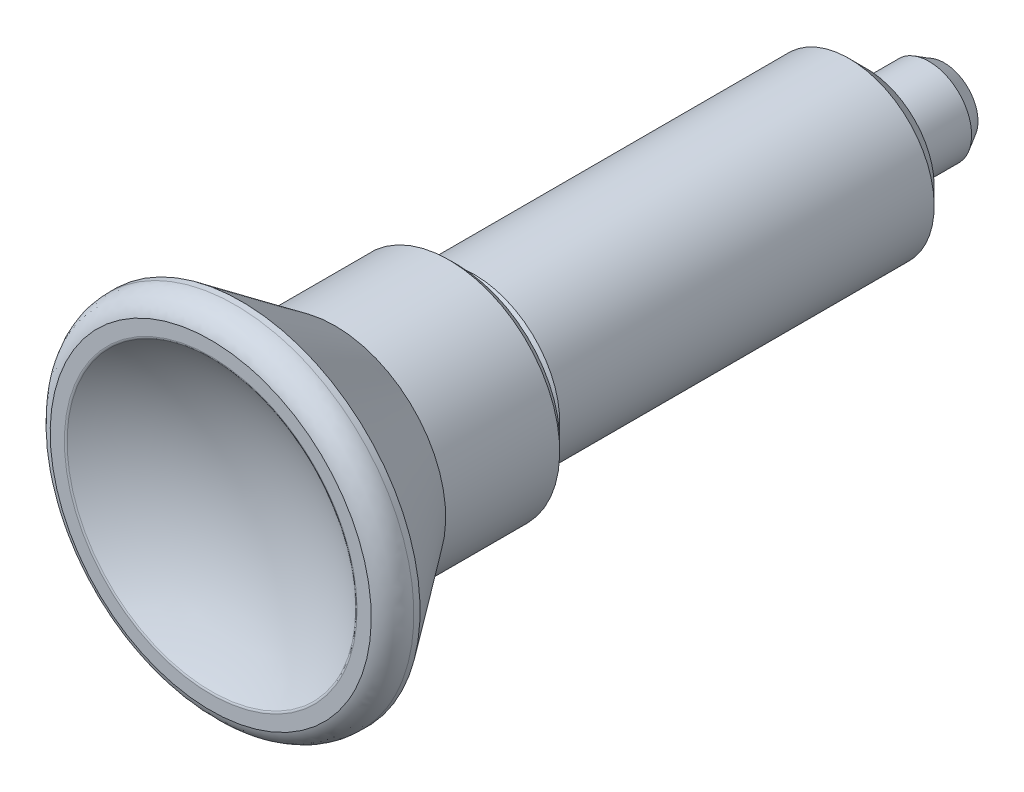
ISO-10303-21;
HEADER;
FILE_DESCRIPTION(('STEP AP214'),'2;1');
FILE_NAME('part.step','',(''),(''),'','','');
FILE_SCHEMA(('AUTOMOTIVE_DESIGN { 1 0 10303 214 1 1 1 1 }'));
ENDSEC;
DATA;
#1=APPLICATION_CONTEXT('core data for automotive mechanical design processes');
#2=APPLICATION_PROTOCOL_DEFINITION('international standard','automotive_design',2000,#1);
#3=PRODUCT_CONTEXT('',#1,'mechanical');
#4=PRODUCT('Part','Part','',(#3));
#5=PRODUCT_RELATED_PRODUCT_CATEGORY('part','',(#4));
#6=PRODUCT_DEFINITION_FORMATION('','',#4);
#7=PRODUCT_DEFINITION_CONTEXT('part definition',#1,'design');
#8=PRODUCT_DEFINITION('design','',#6,#7);
#9=PRODUCT_DEFINITION_SHAPE('','',#8);
#10=(LENGTH_UNIT() NAMED_UNIT(*) SI_UNIT(.MILLI.,.METRE.));
#11=(NAMED_UNIT(*) PLANE_ANGLE_UNIT() SI_UNIT($,.RADIAN.));
#12=(NAMED_UNIT(*) SI_UNIT($,.STERADIAN.) SOLID_ANGLE_UNIT());
#13=UNCERTAINTY_MEASURE_WITH_UNIT(LENGTH_MEASURE(1.E-05),#10,'distance_accuracy_value','');
#14=(GEOMETRIC_REPRESENTATION_CONTEXT(3) GLOBAL_UNCERTAINTY_ASSIGNED_CONTEXT((#13)) GLOBAL_UNIT_ASSIGNED_CONTEXT((#10,
#11,#12)) REPRESENTATION_CONTEXT('',''));
#15=CARTESIAN_POINT('',(0.,0.,0.));
#16=DIRECTION('',(0.,0.,1.));
#17=DIRECTION('',(1.,0.,0.));
#18=AXIS2_PLACEMENT_3D('',#15,#16,#17);
#19=CARTESIAN_POINT('',(-4.42791074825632E-10,6.64607258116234E-11,1.52503010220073E-10));
#20=DIRECTION('',(-0.923728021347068,-0.383049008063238,0.));
#21=DIRECTION('',(0.,0.,-1.));
#22=AXIS2_PLACEMENT_3D('',#19,#20,#21);
#23=SPHERICAL_SURFACE('',#22,5.);
#24=CARTESIAN_POINT('',(0.,0.,-4.58812253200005));
#25=DIRECTION('',(0.,0.,1.));
#26=DIRECTION('',(0.923728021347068,0.383049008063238,0.));
#27=AXIS2_PLACEMENT_3D('',#24,#25,#26);
#28=CIRCLE('',#27,1.987242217);
#29=CARTESIAN_POINT('',(-1.83428256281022,-0.764551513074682,-4.5881225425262));
#30=VERTEX_POINT('',#29);
#31=CARTESIAN_POINT('',(1.8370555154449,0.757868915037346,-4.5881218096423));
#32=VERTEX_POINT('',#31);
#33=EDGE_CURVE('E42',#30,#32,#28,.T.);
#34=ORIENTED_EDGE('',*,*,#33,.F.);
#35=CARTESIAN_POINT('',(-1.83566823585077,-0.761209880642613,0.));
#36=DIRECTION('',(-0.923728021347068,-0.383049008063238,0.));
#37=DIRECTION('',(-1.92852821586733E-11,4.65064313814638E-11,1.));
#38=AXIS2_PLACEMENT_3D('',#35,#36,#37);
#39=CIRCLE('',#38,4.58812397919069);
#40=CARTESIAN_POINT('',(-1.83567054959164,-0.761210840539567,-4.58812289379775));
#41=VERTEX_POINT('',#40);
#42=EDGE_CURVE('E39',#30,#41,#39,.F.);
#43=ORIENTED_EDGE('',*,*,#42,.T.);
#44=CARTESIAN_POINT('',(0.,0.,-4.58812253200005));
#45=DIRECTION('',(0.,0.,1.));
#46=DIRECTION('',(0.923728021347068,0.383049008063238,0.));
#47=AXIS2_PLACEMENT_3D('',#44,#45,#46);
#48=CIRCLE('',#47,1.987242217);
#49=CARTESIAN_POINT('',(1.83567134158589,0.76121116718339,-4.58812252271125));
#50=VERTEX_POINT('',#49);
#51=EDGE_CURVE('E18',#50,#41,#48,.T.);
#52=ORIENTED_EDGE('',*,*,#51,.F.);
#53=CARTESIAN_POINT('',(1.83567136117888,0.761211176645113,0.));
#54=DIRECTION('',(-0.923728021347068,-0.383049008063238,0.));
#55=DIRECTION('',(-1.92852883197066E-11,4.65064462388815E-11,1.));
#56=AXIS2_PLACEMENT_3D('',#53,#54,#55);
#57=CIRCLE('',#56,4.58812251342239);
#58=EDGE_CURVE('E32',#50,#32,#57,.T.);
#59=ORIENTED_EDGE('',*,*,#58,.T.);
#60=EDGE_LOOP('',(#34,#43,#52,#59));
#61=FACE_BOUND('',#60,.T.);
#62=ADVANCED_FACE('F14',(#61),#23,.T.);
#63=CARTESIAN_POINT('',(0.,0.,-4.58812253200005));
#64=DIRECTION('',(0.,0.,1.));
#65=DIRECTION('',(0.923728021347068,0.383049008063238,0.));
#66=AXIS2_PLACEMENT_3D('',#63,#64,#65);
#67=CONICAL_SURFACE('',#66,1.987242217,0.523598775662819);
#68=ORIENTED_EDGE('',*,*,#51,.T.);
#69=ORIENTED_EDGE('',*,*,#42,.F.);
#70=ORIENTED_EDGE('',*,*,#33,.T.);
#71=ORIENTED_EDGE('',*,*,#58,.F.);
#72=EDGE_LOOP('',(#68,#69,#70,#71));
#73=FACE_BOUND('',#72,.T.);
#74=CARTESIAN_POINT('',(0.,0.,-3.7));
#75=DIRECTION('',(0.,0.,-1.));
#76=DIRECTION('',(-0.923728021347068,-0.383049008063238,0.));
#77=AXIS2_PLACEMENT_3D('',#74,#75,#76);
#78=CIRCLE('',#77,2.5);
#79=CARTESIAN_POINT('',(-2.30932005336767,-0.957622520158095,-3.7));
#80=VERTEX_POINT('',#79);
#81=EDGE_CURVE('E47',#80,#80,#78,.F.);
#82=ORIENTED_EDGE('',*,*,#81,.F.);
#83=EDGE_LOOP('',(#82));
#84=FACE_BOUND('',#83,.T.);
#85=ADVANCED_FACE('F45',(#73,#84),#67,.T.);
#86=CARTESIAN_POINT('',(0.,0.,0.));
#87=DIRECTION('',(0.,0.,-1.));
#88=DIRECTION('',(-0.923728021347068,-0.383049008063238,0.));
#89=AXIS2_PLACEMENT_3D('',#86,#87,#88);
#90=CYLINDRICAL_SURFACE('',#89,2.5);
#91=CARTESIAN_POINT('',(0.,0.,0.));
#92=DIRECTION('',(0.,0.,-1.));
#93=DIRECTION('',(-0.923728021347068,-0.383049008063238,0.));
#94=AXIS2_PLACEMENT_3D('',#91,#92,#93);
#95=CIRCLE('',#94,2.5);
#96=CARTESIAN_POINT('',(-2.30932005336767,-0.957622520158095,0.));
#97=VERTEX_POINT('',#96);
#98=EDGE_CURVE('E346',#97,#97,#95,.F.);
#99=ORIENTED_EDGE('',*,*,#98,.F.);
#100=EDGE_LOOP('',(#99));
#101=FACE_BOUND('',#100,.T.);
#102=ORIENTED_EDGE('',*,*,#81,.T.);
#103=EDGE_LOOP('',(#102));
#104=FACE_BOUND('',#103,.T.);
#105=ADVANCED_FACE('F64',(#101,#104),#90,.T.);
#106=CARTESIAN_POINT('',(5.29516892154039,-2.20153529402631,0.));
#107=DIRECTION('',(0.,0.,-1.));
#108=DIRECTION('',(-0.923728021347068,-0.383049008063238,0.));
#109=AXIS2_PLACEMENT_3D('',#106,#107,#108);
#110=PLANE('',#109);
#111=ORIENTED_EDGE('',*,*,#98,.T.);
#112=EDGE_LOOP('',(#111));
#113=FACE_BOUND('',#112,.T.);
#114=CARTESIAN_POINT('',(0.,0.,0.));
#115=DIRECTION('',(0.,0.,1.));
#116=DIRECTION('',(0.923728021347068,0.383049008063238,0.));
#117=AXIS2_PLACEMENT_3D('',#114,#115,#116);
#118=CIRCLE('',#117,4.0000000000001);
#119=CARTESIAN_POINT('',(3.69491208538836,1.53219603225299,0.));
#120=VERTEX_POINT('',#119);
#121=EDGE_CURVE('E349',#120,#120,#118,.T.);
#122=ORIENTED_EDGE('',*,*,#121,.F.);
#123=EDGE_LOOP('',(#122));
#124=FACE_BOUND('',#123,.T.);
#125=ADVANCED_FACE('F16',(#113,#124),#110,.T.);
#126=CARTESIAN_POINT('',(0.,0.,0.));
#127=DIRECTION('',(0.,0.,1.));
#128=DIRECTION('',(0.923728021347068,0.383049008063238,0.));
#129=AXIS2_PLACEMENT_3D('',#126,#127,#128);
#130=CONICAL_SURFACE('',#129,4.,0.785398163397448);
#131=CARTESIAN_POINT('',(0.,0.,1.));
#132=DIRECTION('',(0.,0.,-1.));
#133=DIRECTION('',(-0.923728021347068,-0.383049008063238,0.));
#134=AXIS2_PLACEMENT_3D('',#131,#132,#133);
#135=CIRCLE('',#134,5.);
#136=CARTESIAN_POINT('',(-4.61864010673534,-1.91524504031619,0.999999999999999));
#137=VERTEX_POINT('',#136);
#138=EDGE_CURVE('E351',#137,#137,#135,.F.);
#139=ORIENTED_EDGE('',*,*,#138,.F.);
#140=EDGE_LOOP('',(#139));
#141=FACE_BOUND('',#140,.T.);
#142=ORIENTED_EDGE('',*,*,#121,.T.);
#143=EDGE_LOOP('',(#142));
#144=FACE_BOUND('',#143,.T.);
#145=ADVANCED_FACE('F68',(#141,#144),#130,.T.);
#146=CARTESIAN_POINT('',(0.,0.,23.));
#147=DIRECTION('',(0.,0.,-1.));
#148=DIRECTION('',(-0.923728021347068,-0.383049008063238,0.));
#149=AXIS2_PLACEMENT_3D('',#146,#147,#148);
#150=CYLINDRICAL_SURFACE('',#149,5.);
#151=ORIENTED_EDGE('',*,*,#138,.T.);
#152=EDGE_LOOP('',(#151));
#153=FACE_BOUND('',#152,.T.);
#154=CARTESIAN_POINT('',(0.,0.,23.));
#155=DIRECTION('',(0.,0.,-1.));
#156=DIRECTION('',(-0.923728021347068,-0.383049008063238,0.));
#157=AXIS2_PLACEMENT_3D('',#154,#155,#156);
#158=CIRCLE('',#157,5.);
#159=CARTESIAN_POINT('',(-4.61864010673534,-1.91524504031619,22.9999999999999));
#160=VERTEX_POINT('',#159);
#161=EDGE_CURVE('E24',#160,#160,#158,.F.);
#162=ORIENTED_EDGE('',*,*,#161,.F.);
#163=EDGE_LOOP('',(#162));
#164=FACE_BOUND('',#163,.T.);
#165=ADVANCED_FACE('F71',(#153,#164),#150,.T.);
#166=CARTESIAN_POINT('',(0.,0.,24.));
#167=DIRECTION('',(0.,0.,-1.));
#168=DIRECTION('',(-0.923728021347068,-0.383049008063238,0.));
#169=AXIS2_PLACEMENT_3D('',#166,#167,#168);
#170=CONICAL_SURFACE('',#169,4.,0.785398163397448);
#171=ORIENTED_EDGE('',*,*,#161,.T.);
#172=EDGE_LOOP('',(#171));
#173=FACE_BOUND('',#172,.T.);
#174=CARTESIAN_POINT('',(0.,0.,24.));
#175=DIRECTION('',(0.,0.,-1.));
#176=DIRECTION('',(-0.923728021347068,-0.383049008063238,0.));
#177=AXIS2_PLACEMENT_3D('',#174,#175,#176);
#178=CIRCLE('',#177,4.);
#179=CARTESIAN_POINT('',(-3.69491208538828,-1.53219603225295,24.));
#180=VERTEX_POINT('',#179);
#181=EDGE_CURVE('E9',#180,#180,#178,.T.);
#182=ORIENTED_EDGE('',*,*,#181,.T.);
#183=EDGE_LOOP('',(#182));
#184=FACE_BOUND('',#183,.T.);
#185=ADVANCED_FACE('F74',(#173,#184),#170,.T.);
#186=CARTESIAN_POINT('',(0.,0.,49.6055276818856));
#187=DIRECTION('',(0.,0.,-1.));
#188=DIRECTION('',(-0.923728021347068,-0.383049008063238,0.));
#189=AXIS2_PLACEMENT_3D('',#186,#187,#188);
#190=SPHERICAL_SURFACE('',#189,14.0000000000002);
#191=CARTESIAN_POINT('',(0.,0.,38.4646826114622));
#192=DIRECTION('',(0.,0.,-1.));
#193=DIRECTION('',(-0.923728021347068,-0.383049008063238,0.));
#194=AXIS2_PLACEMENT_3D('',#191,#192,#193);
#195=CIRCLE('',#194,8.47830001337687);
#196=CARTESIAN_POINT('',(-7.83164329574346,-3.24760441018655,38.4646826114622));
#197=VERTEX_POINT('',#196);
#198=EDGE_CURVE('E50',#197,#197,#195,.T.);
#199=ORIENTED_EDGE('',*,*,#198,.F.);
#200=EDGE_LOOP('',(#199));
#201=FACE_BOUND('',#200,.T.);
#202=ADVANCED_FACE('F60',(#201),#190,.F.);
#203=CARTESIAN_POINT('',(-7.83164329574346,-3.24760441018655,38.4646826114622));
#204=CARTESIAN_POINT('',(-7.88122176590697,-3.26816347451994,38.5055276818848));
#205=CARTESIAN_POINT('',(-7.94352391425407,-3.2939987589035,38.5055276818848));
#206=CARTESIAN_POINT('',(-13.4566591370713,10.3171996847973,38.4646826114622));
#207=CARTESIAN_POINT('',(-13.5418469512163,10.3825130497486,38.5055276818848));
#208=CARTESIAN_POINT('',(-13.6488971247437,10.4645882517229,38.5055276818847));
#209=CARTESIAN_POINT('',(1.10331372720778,8.40620425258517,38.4646826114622));
#210=CARTESIAN_POINT('',(1.11029829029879,8.45941999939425,38.5055276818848));
#211=CARTESIAN_POINT('',(1.11907535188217,8.52629288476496,38.5055276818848));
#212=CARTESIAN_POINT('',(15.6632865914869,6.49520882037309,38.4646826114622));
#213=CARTESIAN_POINT('',(15.7624435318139,6.53632694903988,38.5055276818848));
#214=CARTESIAN_POINT('',(15.8870478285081,6.58799751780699,38.5055276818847));
#215=CARTESIAN_POINT('',(6.72832956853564,-5.15859984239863,38.4646826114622));
#216=CARTESIAN_POINT('',(6.77092347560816,-5.19125652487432,38.5055276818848));
#217=CARTESIAN_POINT('',(6.82444856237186,-5.23229412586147,38.5055276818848));
#218=CARTESIAN_POINT('',(-2.20662745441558,-16.8124085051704,38.4646826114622));
#219=CARTESIAN_POINT('',(-2.2205965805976,-16.9188399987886,38.5055276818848));
#220=CARTESIAN_POINT('',(-2.23815070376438,-17.0525857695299,38.5055276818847));
#221=CARTESIAN_POINT('',(-7.83164329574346,-3.24760441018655,38.4646826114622));
#222=CARTESIAN_POINT('',(-7.88122176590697,-3.26816347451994,38.5055276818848));
#223=CARTESIAN_POINT('',(-7.94352391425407,-3.2939987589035,38.5055276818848));
#224=(BOUNDED_SURFACE() B_SPLINE_SURFACE(2,2,((#203,#204,#205),(#206,#207,#208),(#209,#210,
#211),(#212,#213,#214),(#215,#216,#217),(#218,#219,#220),(#221,#222,#223)),.UNSPECIFIED.,.T.,
.F.,.F.) B_SPLINE_SURFACE_WITH_KNOTS((3,2,2,3),(3,3),(0.,219.195240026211,438.390480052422,
657.585720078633),(0.,1.),
.UNSPECIFIED.) GEOMETRIC_REPRESENTATION_ITEM() RATIONAL_B_SPLINE_SURFACE(((1.,0.947569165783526,
1.),(0.5,0.473784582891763,0.5),(1.,0.947569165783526,1.),(0.5,0.473784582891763,0.5),(1.,
0.947569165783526,1.),(0.5,0.473784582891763,0.5),(1.,0.947569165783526,1.))) REPRESENTATION_ITEM('') SURFACE());
#225=CARTESIAN_POINT('',(0.,0.,38.5055276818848));
#226=DIRECTION('',(0.,0.,1.));
#227=DIRECTION('',(-0.923728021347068,-0.383049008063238,0.));
#228=AXIS2_PLACEMENT_3D('',#225,#226,#227);
#229=CIRCLE('',#228,8.59941858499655);
#230=CARTESIAN_POINT('',(-7.94352391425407,-3.2939987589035,38.5055276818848));
#231=VERTEX_POINT('',#230);
#232=EDGE_CURVE('E146',#231,#231,#229,.T.);
#233=CARTESIAN_POINT('',(-7.83164329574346,-3.24760441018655,38.4646826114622));
#234=CARTESIAN_POINT('',(-7.83262359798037,-3.2480109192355,38.4654902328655));
#235=CARTESIAN_POINT('',(-7.83361136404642,-3.2484205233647,38.4662872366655));
#236=CARTESIAN_POINT('',(-7.83560449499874,-3.24924702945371,38.467862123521));
#237=CARTESIAN_POINT('',(-7.8366099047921,-3.24966395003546,38.4686399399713));
#238=CARTESIAN_POINT('',(-7.83863786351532,-3.25050489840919,38.4701757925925));
#239=CARTESIAN_POINT('',(-7.83966045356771,-3.25092894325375,38.4709337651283));
#240=CARTESIAN_POINT('',(-7.84172228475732,-3.25178393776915,38.4724292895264));
#241=CARTESIAN_POINT('',(-7.84276156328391,-3.25221490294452,38.4731667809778));
#242=CARTESIAN_POINT('',(-7.84485625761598,-3.2530835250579,38.4746207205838));
#243=CARTESIAN_POINT('',(-7.84591170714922,-3.25352119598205,38.4753371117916));
#244=CARTESIAN_POINT('',(-7.84803820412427,-3.2544030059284,38.4767482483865));
#245=CARTESIAN_POINT('',(-7.84910928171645,-3.25484715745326,38.4774429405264));
#246=CARTESIAN_POINT('',(-7.85126647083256,-3.25574169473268,38.4788100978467));
#247=CARTESIAN_POINT('',(-7.85235260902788,-3.25619209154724,38.479482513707));
#248=CARTESIAN_POINT('',(-7.85453933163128,-3.25709887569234,38.4808045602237));
#249=CARTESIAN_POINT('',(-7.85563993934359,-3.25755527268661,38.4814541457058));
#250=CARTESIAN_POINT('',(-7.85785499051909,-3.25847380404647,38.4827299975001));
#251=CARTESIAN_POINT('',(-7.8589694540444,-3.25893594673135,38.4833562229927));
#252=CARTESIAN_POINT('',(-7.86121158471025,-3.25986570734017,38.4845848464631));
#253=CARTESIAN_POINT('',(-7.86233926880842,-3.26033333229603,38.4851872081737));
#254=CARTESIAN_POINT('',(-7.86460718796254,-3.26127378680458,38.4863676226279));
#255=CARTESIAN_POINT('',(-7.8657474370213,-3.26174662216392,38.486945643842));
#256=CARTESIAN_POINT('',(-7.86803981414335,-3.26269721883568,38.4880769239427));
#257=CARTESIAN_POINT('',(-7.86919195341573,-3.26317498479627,38.48863015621));
#258=CARTESIAN_POINT('',(-7.87150742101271,-3.26413515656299,38.4897114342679));
#259=CARTESIAN_POINT('',(-7.87267075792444,-3.26461756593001,38.4902394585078));
#260=CARTESIAN_POINT('',(-7.87500791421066,-3.26558673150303,38.4912699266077));
#261=CARTESIAN_POINT('',(-7.8761817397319,-3.26607349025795,38.4917723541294));
#262=CARTESIAN_POINT('',(-7.87853915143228,-3.26705105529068,38.492751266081));
#263=CARTESIAN_POINT('',(-7.87972274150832,-3.26754186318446,38.4932277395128));
#264=CARTESIAN_POINT('',(-7.88209894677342,-3.26852722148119,38.4941544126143));
#265=CARTESIAN_POINT('',(-7.88329156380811,-3.26902177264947,38.4946046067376));
#266=CARTESIAN_POINT('',(-7.88568507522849,-3.27001430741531,38.4954784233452));
#267=CARTESIAN_POINT('',(-7.88688596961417,-3.27051229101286,38.4959020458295));
#268=CARTESIAN_POINT('',(-7.8892952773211,-3.27151137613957,38.4967224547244));
#269=CARTESIAN_POINT('',(-7.89050368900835,-3.27201247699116,38.4971192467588));
#270=CARTESIAN_POINT('',(-7.89292726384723,-3.27301747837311,38.4978857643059));
#271=CARTESIAN_POINT('',(-7.89414242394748,-3.27352137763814,38.4982555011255));
#272=CARTESIAN_POINT('',(-7.8965787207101,-3.27453165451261,38.4989677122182));
#273=CARTESIAN_POINT('',(-7.89779985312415,-3.27503803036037,38.4993102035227));
#274=CARTESIAN_POINT('',(-7.90024731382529,-3.27605293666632,38.4999677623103));
#275=CARTESIAN_POINT('',(-7.90147363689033,-3.27656146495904,38.5002828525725));
#276=CARTESIAN_POINT('',(-7.90393069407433,-3.27758035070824,38.5008854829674));
#277=CARTESIAN_POINT('',(-7.90516142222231,-3.27809070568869,38.5011730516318));
#278=CARTESIAN_POINT('',(-7.90762650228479,-3.27911291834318,38.5017205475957));
#279=CARTESIAN_POINT('',(-7.90886084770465,-3.27962477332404,38.5019805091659));
#280=CARTESIAN_POINT('',(-7.91133237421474,-3.28064965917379,38.5024727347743));
#281=CARTESIAN_POINT('',(-7.91256954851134,-3.28116268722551,38.5027050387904));
#282=CARTESIAN_POINT('',(-7.91504594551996,-3.28218959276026,38.5031419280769));
#283=CARTESIAN_POINT('',(-7.91628516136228,-3.28270346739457,38.503346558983));
#284=CARTESIAN_POINT('',(-7.91876485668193,-3.28373174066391,38.5037281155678));
#285=CARTESIAN_POINT('',(-7.9200053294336,-3.28424613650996,38.5039050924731));
#286=CARTESIAN_POINT('',(-7.92248675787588,-3.28527512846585,38.5042313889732));
#287=CARTESIAN_POINT('',(-7.92372770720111,-3.28578972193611,38.5043807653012));
#288=CARTESIAN_POINT('',(-7.92620931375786,-3.28681878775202,38.5046519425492));
#289=CARTESIAN_POINT('',(-7.92744996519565,-3.28733325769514,38.5047738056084));
#290=CARTESIAN_POINT('',(-7.92993020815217,-3.28836175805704,38.5049900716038));
#291=CARTESIAN_POINT('',(-7.93116979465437,-3.28887578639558,38.5050845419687));
#292=CARTESIAN_POINT('',(-7.93364714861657,-3.28990308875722,38.5052461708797));
#293=CARTESIAN_POINT('',(-7.93488491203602,-3.29041636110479,38.5053134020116));
#294=CARTESIAN_POINT('',(-7.93735787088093,-3.29144184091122,38.5054207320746));
#295=CARTESIAN_POINT('',(-7.938593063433,-3.29195404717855,38.5054609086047));
#296=CARTESIAN_POINT('',(-7.94106014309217,-3.29297708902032,38.5055143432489));
#297=CARTESIAN_POINT('',(-7.94229202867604,-3.29348792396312,38.5055276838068));
#298=CARTESIAN_POINT('',(-7.94352391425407,-3.2939987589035,38.5055276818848));
#299=B_SPLINE_CURVE_WITH_KNOTS('',3,(#233,#234,#235,#236,#237,#238,#239,#240,#241,#242,#243,
#244,#245,#246,#247,#248,#249,#250,#251,#252,#253,#254,#255,#256,#257,#258,#259,#260,#261,#262,
#263,#264,#265,#266,#267,#268,#269,#270,#271,#272,#273,#274,#275,#276,#277,#278,#279,#280,#281,
#282,#283,#284,#285,#286,#287,#288,#289,#290,#291,#292,#293,#294,#295,#296,#297,#298),
.UNSPECIFIED.,.F.,.F.,(4,2,2,2,2,2,2,2,2,2,2,2,2,2,2,2,2,2,2,2,2,2,2,2,2,2,2,2,2,2,2,2,4),(0.,
0.0040007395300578,0.00801382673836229,0.0120385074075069,0.0160740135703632,0.0201195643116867,
0.0241743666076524,0.0282376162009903,0.032308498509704,0.0363861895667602,0.0404698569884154,
0.0445586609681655,0.0486517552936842,0.0527482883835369,0.0568474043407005,0.0609482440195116,
0.0650499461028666,0.069151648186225,0.0732524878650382,0.0773516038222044,0.0814481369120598,
0.0855412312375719,0.0896300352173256,0.0937137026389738,0.0977913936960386,0.101862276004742,
0.105925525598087,0.109980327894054,0.114025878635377,0.11806138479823,0.122086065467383,
0.126099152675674,0.13009989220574),.UNSPECIFIED.);
#300=EDGE_CURVE('BSEAM83',#197,#231,#299,.T.);
#301=ORIENTED_EDGE('',*,*,#198,.T.);
#302=ORIENTED_EDGE('',*,*,#232,.T.);
#303=ORIENTED_EDGE('',*,*,#300,.T.);
#304=ORIENTED_EDGE('',*,*,#300,.F.);
#305=EDGE_LOOP('',(#301,#303,#302,#304));
#306=FACE_BOUND('',#305,.T.);
#307=ADVANCED_FACE('F83',(#306),#224,.T.);
#308=CARTESIAN_POINT('',(5.60947778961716,13.5576498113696,38.5055276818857));
#309=DIRECTION('',(0.,0.,1.));
#310=DIRECTION('',(-0.923728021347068,-0.383049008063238,0.));
#311=AXIS2_PLACEMENT_3D('',#308,#309,#310);
#312=PLANE('',#311);
#313=CARTESIAN_POINT('',(0.,0.,38.5055276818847));
#314=DIRECTION('',(0.,0.,-1.));
#315=DIRECTION('',(-0.923728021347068,-0.383049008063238,0.));
#316=AXIS2_PLACEMENT_3D('',#313,#314,#315);
#317=CIRCLE('',#316,9.43170557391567);
#318=CARTESIAN_POINT('',(-8.71233072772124,-3.61280546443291,38.5055276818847));
#319=VERTEX_POINT('',#318);
#320=EDGE_CURVE('E153',#319,#319,#317,.T.);
#321=ORIENTED_EDGE('',*,*,#320,.F.);
#322=EDGE_LOOP('',(#321));
#323=FACE_BOUND('',#322,.T.);
#324=ORIENTED_EDGE('',*,*,#232,.F.);
#325=EDGE_LOOP('',(#324));
#326=FACE_BOUND('',#325,.T.);
#327=ADVANCED_FACE('F120',(#323,#326),#312,.T.);
#328=CARTESIAN_POINT('',(-8.71233072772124,-3.61280546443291,38.5055276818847));
#329=CARTESIAN_POINT('',(-9.69914422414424,-4.02201458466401,38.1844850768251));
#330=CARTESIAN_POINT('',(-9.69914422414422,-4.022014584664,37.0689935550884));
#331=CARTESIAN_POINT('',(-14.9698933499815,11.4773940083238,38.5055276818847));
#332=CARTESIAN_POINT('',(-16.6654778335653,12.777396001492,38.1844850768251));
#333=CARTESIAN_POINT('',(-16.6654778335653,12.777396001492,37.0689935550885));
#334=CARTESIAN_POINT('',(1.22738405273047,9.35150246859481,38.5055276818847));
#335=CARTESIAN_POINT('',(1.36640530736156,10.41071258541,38.1844850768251));
#336=CARTESIAN_POINT('',(1.36640530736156,10.41071258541,37.0689935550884));
#337=CARTESIAN_POINT('',(17.4246614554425,7.22561092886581,38.5055276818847));
#338=CARTESIAN_POINT('',(19.3982884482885,8.044029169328,38.1844850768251));
#339=CARTESIAN_POINT('',(19.3982884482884,8.04402916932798,37.0689935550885));
#340=CARTESIAN_POINT('',(7.48494667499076,-5.73869700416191,38.5055276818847));
#341=CARTESIAN_POINT('',(8.33273891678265,-6.38869800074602,38.1844850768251));
#342=CARTESIAN_POINT('',(8.33273891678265,-6.38869800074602,37.0689935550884));
#343=CARTESIAN_POINT('',(-2.45476810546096,-18.7030049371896,38.5055276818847));
#344=CARTESIAN_POINT('',(-2.73281061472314,-20.82142517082,38.1844850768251));
#345=CARTESIAN_POINT('',(-2.73281061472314,-20.82142517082,37.0689935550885));
#346=CARTESIAN_POINT('',(-8.71233072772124,-3.61280546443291,38.5055276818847));
#347=CARTESIAN_POINT('',(-9.69914422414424,-4.02201458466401,38.1844850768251));
#348=CARTESIAN_POINT('',(-9.69914422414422,-4.022014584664,37.0689935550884));
#349=(BOUNDED_SURFACE() B_SPLINE_SURFACE(2,2,((#328,#329,#330),(#331,#332,#333),(#334,#335,
#336),(#337,#338,#339),(#340,#341,#342),(#343,#344,#345),(#346,#347,#348)),.UNSPECIFIED.,.T.,
.F.,.F.) B_SPLINE_SURFACE_WITH_KNOTS((3,2,2,3),(3,3),(0.,15.8434592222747,31.6869184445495,
47.5303776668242),(0.,1.),
.UNSPECIFIED.) GEOMETRIC_REPRESENTATION_ITEM() RATIONAL_B_SPLINE_SURFACE(((1.,0.802434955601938,
1.),(0.5,0.401217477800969,0.5),(1.,0.802434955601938,1.),(0.5,0.401217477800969,0.5),(1.,
0.802434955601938,1.),(0.5,0.401217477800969,0.5),(1.,0.802434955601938,1.))) REPRESENTATION_ITEM('') SURFACE());
#350=CARTESIAN_POINT('',(0.,0.,37.0689935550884));
#351=DIRECTION('',(0.,0.,-1.));
#352=DIRECTION('',(-0.923728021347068,-0.383049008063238,0.));
#353=AXIS2_PLACEMENT_3D('',#350,#351,#352);
#354=CIRCLE('',#353,10.5);
#355=CARTESIAN_POINT('',(-9.69914422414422,-4.022014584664,37.0689935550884));
#356=VERTEX_POINT('',#355);
#357=EDGE_CURVE('E158',#356,#356,#354,.T.);
#358=CARTESIAN_POINT('',(-8.71233072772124,-3.61280546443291,38.5055276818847));
#359=CARTESIAN_POINT('',(-8.71646131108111,-3.61451832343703,38.5041838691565));
#360=CARTESIAN_POINT('',(-8.72058609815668,-3.61622877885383,38.5028191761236));
#361=CARTESIAN_POINT('',(-8.72883629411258,-3.61964994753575,38.5000439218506));
#362=CARTESIAN_POINT('',(-8.73296166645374,-3.62136064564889,38.4986332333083));
#363=CARTESIAN_POINT('',(-8.74121243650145,-3.62478205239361,38.4957657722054));
#364=CARTESIAN_POINT('',(-8.74533779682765,-3.62649274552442,38.4943088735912));
#365=CARTESIAN_POINT('',(-8.75358793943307,-3.6299138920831,38.4913487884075));
#366=CARTESIAN_POINT('',(-8.75771268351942,-3.63162432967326,38.489845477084));
#367=CARTESIAN_POINT('',(-8.76596098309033,-3.63504471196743,38.4867923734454));
#368=CARTESIAN_POINT('',(-8.77008449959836,-3.63675464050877,38.4852424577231));
#369=CARTESIAN_POINT('',(-8.77832972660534,-3.64017374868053,38.4820959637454));
#370=CARTESIAN_POINT('',(-8.78245139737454,-3.64188291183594,38.4804992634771));
#371=CARTESIAN_POINT('',(-8.79069230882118,-3.64530023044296,38.4772590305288));
#372=CARTESIAN_POINT('',(-8.79481150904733,-3.64700836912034,38.4756153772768));
#373=CARTESIAN_POINT('',(-8.80304684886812,-3.6504233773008,38.4722810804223));
#374=CARTESIAN_POINT('',(-8.80716294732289,-3.6521302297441,38.4705903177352));
#375=CARTESIAN_POINT('',(-8.81539144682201,-3.65554240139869,38.4671616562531));
#376=CARTESIAN_POINT('',(-8.81950380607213,-3.65724770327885,38.465423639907));
#377=CARTESIAN_POINT('',(-8.82772418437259,-3.660656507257,38.4619003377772));
#378=CARTESIAN_POINT('',(-8.83183216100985,-3.66235999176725,38.4601149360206));
#379=CARTESIAN_POINT('',(-8.84004312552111,-3.66576489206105,38.4564967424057));
#380=CARTESIAN_POINT('',(-8.84414607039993,-3.66746629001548,38.4546638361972));
#381=CARTESIAN_POINT('',(-8.85234631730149,-3.67086674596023,38.4509505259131));
#382=CARTESIAN_POINT('',(-8.85644357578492,-3.67256578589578,38.4490700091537));
#383=CARTESIAN_POINT('',(-8.86463179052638,-3.6759612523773,38.4452613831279));
#384=CARTESIAN_POINT('',(-8.86872270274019,-3.67765766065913,38.4433331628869));
#385=CARTESIAN_POINT('',(-8.87689756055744,-3.68104758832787,38.4394290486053));
#386=CARTESIAN_POINT('',(-8.88098146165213,-3.68274108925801,38.4374530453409));
#387=CARTESIAN_POINT('',(-8.88914162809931,-3.68612492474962,38.4334532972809));
#388=CARTESIAN_POINT('',(-8.89321784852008,-3.68781524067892,38.4314294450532));
#389=CARTESIAN_POINT('',(-8.90136198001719,-3.69119242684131,38.4273339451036));
#390=CARTESIAN_POINT('',(-8.90542984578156,-3.69287927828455,38.4252621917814));
#391=CARTESIAN_POINT('',(-8.91355659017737,-3.69624925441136,38.4210708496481));
#392=CARTESIAN_POINT('',(-8.91761542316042,-3.69793236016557,38.4189511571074));
#393=CARTESIAN_POINT('',(-8.9257234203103,-3.70129456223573,38.4146639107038));
#394=CARTESIAN_POINT('',(-8.92977253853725,-3.70297363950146,38.4124962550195));
#395=CARTESIAN_POINT('',(-8.93786042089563,-3.70632750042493,38.408113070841));
#396=CARTESIAN_POINT('',(-8.94189913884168,-3.70800226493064,38.4058974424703));
#397=CARTESIAN_POINT('',(-8.94996553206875,-3.71134721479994,38.4014183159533));
#398=CARTESIAN_POINT('',(-8.9539931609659,-3.7130173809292,38.3991547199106));
#399=CARTESIAN_POINT('',(-8.96203668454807,-3.71635284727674,38.3945796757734));
#400=CARTESIAN_POINT('',(-8.96605253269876,-3.71801812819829,38.3922681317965));
#401=CARTESIAN_POINT('',(-8.97407180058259,-3.72134353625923,38.3875972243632));
#402=CARTESIAN_POINT('',(-8.97807517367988,-3.72300364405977,38.3852377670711));
#403=CARTESIAN_POINT('',(-8.98606879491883,-3.72631841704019,38.3804710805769));
#404=CARTESIAN_POINT('',(-8.99005899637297,-3.7279730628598,38.3780637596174));
#405=CARTESIAN_POINT('',(-8.99802557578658,-3.73127662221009,38.3732014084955));
#406=CARTESIAN_POINT('',(-9.00200190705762,-3.73292551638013,38.3707462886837));
#407=CARTESIAN_POINT('',(-9.00994004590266,-3.73621728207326,38.3657884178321));
#408=CARTESIAN_POINT('',(-9.01390180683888,-3.73786013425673,38.363285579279));
#409=CARTESIAN_POINT('',(-9.02181010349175,-3.74113952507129,38.3582323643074));
#410=CARTESIAN_POINT('',(-9.02575659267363,-3.74277604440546,38.3556819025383));
#411=CARTESIAN_POINT('',(-9.03363364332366,-3.74604247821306,38.350533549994));
#412=CARTESIAN_POINT('',(-9.0375641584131,-3.7476723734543,38.3479355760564));
#413=CARTESIAN_POINT('',(-9.0454085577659,-3.75092526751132,38.3426923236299));
#414=CARTESIAN_POINT('',(-9.04932239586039,-3.75254824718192,38.3400469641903));
#415=CARTESIAN_POINT('',(-9.05713273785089,-3.75578701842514,38.3347090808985));
#416=CARTESIAN_POINT('',(-9.06102919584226,-3.75740279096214,38.3320164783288));
#417=CARTESIAN_POINT('',(-9.0688040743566,-3.76062685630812,38.3265842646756));
#418=CARTESIAN_POINT('',(-9.07268244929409,-3.76223513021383,38.3238445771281));
#419=CARTESIAN_POINT('',(-9.08042045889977,-3.76544390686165,38.3183183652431));
#420=CARTESIAN_POINT('',(-9.08428004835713,-3.76704439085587,38.3155317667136));
#421=CARTESIAN_POINT('',(-9.09197978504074,-3.7702372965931,38.3099119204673));
#422=CARTESIAN_POINT('',(-9.09581988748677,-3.77182969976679,38.307078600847));
#423=CARTESIAN_POINT('',(-9.10347994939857,-3.77500615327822,38.3013655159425));
#424=CARTESIAN_POINT('',(-9.10729986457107,-3.77659018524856,38.2984856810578));
#425=CARTESIAN_POINT('',(-9.11491885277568,-3.77974960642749,38.2926797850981));
#426=CARTESIAN_POINT('',(-9.11871788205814,-3.78132497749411,38.2897536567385));
#427=CARTESIAN_POINT('',(-9.1262944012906,-3.78446678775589,38.2838554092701));
#428=CARTESIAN_POINT('',(-9.13007184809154,-3.78603320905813,38.2808832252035));
#429=CARTESIAN_POINT('',(-9.13760450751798,-3.78915683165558,38.2748931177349));
#430=CARTESIAN_POINT('',(-9.14135967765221,-3.79071401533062,38.2718751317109));
#431=CARTESIAN_POINT('',(-9.14884709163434,-3.79381887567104,38.2657936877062));
#432=CARTESIAN_POINT('',(-9.15257929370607,-3.79536653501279,38.2627301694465));
#433=CARTESIAN_POINT('',(-9.16002008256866,-3.79845206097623,38.2565579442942));
#434=CARTESIAN_POINT('',(-9.16372862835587,-3.79998991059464,38.2534491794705));
#435=CARTESIAN_POINT('',(-9.17112141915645,-3.80305553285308,38.247186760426));
#436=CARTESIAN_POINT('',(-9.17480562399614,-3.80458328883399,38.2440330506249));
#437=CARTESIAN_POINT('',(-9.18214905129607,-3.80762844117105,38.2376810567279));
#438=CARTESIAN_POINT('',(-9.18580823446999,-3.80914582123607,38.2344827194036));
#439=CARTESIAN_POINT('',(-9.19310094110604,-3.81216994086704,38.2280418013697));
#440=CARTESIAN_POINT('',(-9.19673442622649,-3.81367666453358,38.2247991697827));
#441=CARTESIAN_POINT('',(-9.20397506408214,-3.81667919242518,38.2182700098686));
#442=CARTESIAN_POINT('',(-9.20758217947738,-3.81817498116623,38.2149834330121));
#443=CARTESIAN_POINT('',(-9.21476941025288,-3.82115536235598,38.2083667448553));
#444=CARTESIAN_POINT('',(-9.21834948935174,-3.82263993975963,38.2050365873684));
#445=CARTESIAN_POINT('',(-9.22548198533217,-3.82559762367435,38.1983331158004));
#446=CARTESIAN_POINT('',(-9.22903436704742,-3.82707071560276,38.1949597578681));
#447=CARTESIAN_POINT('',(-9.23611081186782,-3.83000515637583,38.1881702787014));
#448=CARTESIAN_POINT('',(-9.23963484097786,-3.83146649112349,38.1847541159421));
#449=CARTESIAN_POINT('',(-9.24665393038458,-3.83437714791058,38.1778794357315));
#450=CARTESIAN_POINT('',(-9.25014895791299,-3.83582645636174,38.1744208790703));
#451=CARTESIAN_POINT('',(-9.2571094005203,-3.83871279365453,38.1674618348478));
#452=CARTESIAN_POINT('',(-9.26057478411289,-3.84014980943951,38.1639613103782));
#453=CARTESIAN_POINT('',(-9.26747530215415,-3.84301129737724,38.156918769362));
#454=CARTESIAN_POINT('',(-9.27091040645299,-3.84443575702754,38.1533767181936));
#455=CARTESIAN_POINT('',(-9.27774973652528,-3.84727187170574,38.1462515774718));
#456=CARTESIAN_POINT('',(-9.28115393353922,-3.84868351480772,38.1426684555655));
#457=CARTESIAN_POINT('',(-9.28793082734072,-3.85149373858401,38.1354616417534));
#458=CARTESIAN_POINT('',(-9.2913034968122,-3.85289230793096,38.1318379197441));
#459=CARTESIAN_POINT('',(-9.29801672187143,-3.85567612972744,38.1245503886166));
#460=CARTESIAN_POINT('',(-9.3013572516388,-3.85706137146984,38.1208865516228));
#461=CARTESIAN_POINT('',(-9.30800559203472,-3.8598182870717,38.1135192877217));
#462=CARTESIAN_POINT('',(-9.31131337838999,-3.86118995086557,38.109815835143));
#463=CARTESIAN_POINT('',(-9.31789563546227,-3.86391946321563,38.1023698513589));
#464=CARTESIAN_POINT('',(-9.32117008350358,-3.8652773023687,38.0986272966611));
#465=CARTESIAN_POINT('',(-9.32768507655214,-3.86797892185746,38.0911036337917));
#466=CARTESIAN_POINT('',(-9.3309256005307,-3.86932269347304,38.0873225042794));
#467=CARTESIAN_POINT('',(-9.3373721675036,-3.871995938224,38.0797222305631));
#468=CARTESIAN_POINT('',(-9.34057819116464,-3.87332540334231,38.0759030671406));
#469=CARTESIAN_POINT('',(-9.34695518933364,-3.87596979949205,38.0682272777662));
#470=CARTESIAN_POINT('',(-9.3501261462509,-3.87728472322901,38.0643706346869));
#471=CARTESIAN_POINT('',(-9.35643245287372,-3.87989980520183,38.0566204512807));
#472=CARTESIAN_POINT('',(-9.35956778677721,-3.88119995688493,38.0527268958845));
#473=CARTESIAN_POINT('',(-9.36580229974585,-3.8837852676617,38.0449034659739));
#474=CARTESIAN_POINT('',(-9.36890146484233,-3.88507042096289,38.0409735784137));
#475=CARTESIAN_POINT('',(-9.3750631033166,-3.88762551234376,38.0330780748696));
#476=CARTESIAN_POINT('',(-9.37812556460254,-3.88889544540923,38.0291124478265));
#477=CARTESIAN_POINT('',(-9.38421326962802,-3.89141987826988,38.0211460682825));
#478=CARTESIAN_POINT('',(-9.38723850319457,-3.89267437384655,38.0171453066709));
#479=CARTESIAN_POINT('',(-9.39325123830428,-3.89516771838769,38.0091092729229));
#480=CARTESIAN_POINT('',(-9.39623873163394,-3.89640656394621,38.0050739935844));
#481=CARTESIAN_POINT('',(-9.40217548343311,-3.89886839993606,37.996969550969));
#482=CARTESIAN_POINT('',(-9.40512473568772,-3.90009138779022,37.9929003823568));
#483=CARTESIAN_POINT('',(-9.41098451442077,-3.90252130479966,37.9847287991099));
#484=CARTESIAN_POINT('',(-9.4138950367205,-3.90372823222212,37.9806263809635));
#485=CARTESIAN_POINT('',(-9.41967687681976,-3.90612582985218,37.9723889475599));
#486=CARTESIAN_POINT('',(-9.42254819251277,-3.90731649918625,37.9682539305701));
#487=CARTESIAN_POINT('',(-9.4282511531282,-3.90968138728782,37.959951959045));
#488=CARTESIAN_POINT('',(-9.43108279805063,-3.91085560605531,37.9557850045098));
#489=CARTESIAN_POINT('',(-9.43670596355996,-3.91318740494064,37.9474198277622));
#490=CARTESIAN_POINT('',(-9.43949748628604,-3.91434498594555,37.9432216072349));
#491=CARTESIAN_POINT('',(-9.44503996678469,-3.91664332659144,37.9347945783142));
#492=CARTESIAN_POINT('',(-9.44779092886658,-3.91778408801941,37.9305657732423));
#493=CARTESIAN_POINT('',(-9.45325186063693,-3.92004861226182,37.9220782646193));
#494=CARTESIAN_POINT('',(-9.45596183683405,-3.92117237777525,37.9178195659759));
#495=CARTESIAN_POINT('',(-9.46134038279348,-3.92340273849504,37.9092729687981));
#496=CARTESIAN_POINT('',(-9.46400896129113,-3.92450933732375,37.9049850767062));
#497=CARTESIAN_POINT('',(-9.46930431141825,-3.92670519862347,37.8963808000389));
#498=CARTESIAN_POINT('',(-9.47193109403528,-3.92779446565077,37.8920644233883));
#499=CARTESIAN_POINT('',(-9.47714246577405,-3.92995550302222,37.8834038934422));
#500=CARTESIAN_POINT('',(-9.47972706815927,-3.93102727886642,37.8790597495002));
#501=CARTESIAN_POINT('',(-9.4848537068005,-3.93315317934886,37.8703444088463));
#502=CARTESIAN_POINT('',(-9.48739575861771,-3.93420731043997,37.8659732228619));
#503=CARTESIAN_POINT('',(-9.49243693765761,-3.93629777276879,37.8572045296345));
#504=CARTESIAN_POINT('',(-9.49493608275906,-3.93733411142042,37.8528070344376));
#505=CARTESIAN_POINT('',(-9.49989110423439,-3.93938884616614,37.8439864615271));
#506=CARTESIAN_POINT('',(-9.50234700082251,-3.94040725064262,37.8395633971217));
#507=CARTESIAN_POINT('',(-9.50721519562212,-3.94242598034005,37.830692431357));
#508=CARTESIAN_POINT('',(-9.50962751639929,-3.94342631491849,37.8262445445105));
#509=CARTESIAN_POINT('',(-9.51440824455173,-3.94540877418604,37.8173246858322));
#510=CARTESIAN_POINT('',(-9.5167766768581,-3.94639090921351,37.8128527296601));
#511=CARTESIAN_POINT('',(-9.52146932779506,-3.94833684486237,37.8038854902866));
#512=CARTESIAN_POINT('',(-9.52379357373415,-3.94930065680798,37.7993902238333));
#513=CARTESIAN_POINT('',(-9.52839756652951,-3.95120982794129,37.7903771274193));
#514=CARTESIAN_POINT('',(-9.53067734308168,-3.95215519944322,37.7858593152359));
#515=CARTESIAN_POINT('',(-9.53519212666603,-3.95402737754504,37.7768018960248));
#516=CARTESIAN_POINT('',(-9.5374271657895,-3.95495419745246,37.772262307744));
#517=CARTESIAN_POINT('',(-9.54185221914,-3.95678916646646,37.7631621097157));
#518=CARTESIAN_POINT('',(-9.54404226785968,-3.95769732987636,37.7586015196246));
#519=CARTESIAN_POINT('',(-9.54837710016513,-3.9594948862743,37.7494600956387));
#520=CARTESIAN_POINT('',(-9.55052192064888,-3.96038429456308,37.7448792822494));
#521=CARTESIAN_POINT('',(-9.55476607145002,-3.96214424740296,37.7356981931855));
#522=CARTESIAN_POINT('',(-9.55686544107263,-3.96301480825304,37.731097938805));
#523=CARTESIAN_POINT('',(-9.56101848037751,-3.96473697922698,37.7218787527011));
#524=CARTESIAN_POINT('',(-9.56307219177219,-3.96558860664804,37.7172598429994));
#525=CARTESIAN_POINT('',(-9.56713372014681,-3.96727283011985,37.7080041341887));
#526=CARTESIAN_POINT('',(-9.5691415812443,-3.96810544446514,37.7033673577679));
#527=CARTESIAN_POINT('',(-9.57311122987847,-3.96975156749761,37.6940767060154));
#528=CARTESIAN_POINT('',(-9.57507306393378,-3.97056509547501,37.6894228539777));
#529=CARTESIAN_POINT('',(-9.57895049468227,-3.97217297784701,37.6800988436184));
#530=CARTESIAN_POINT('',(-9.58086614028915,-3.972967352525,37.6754287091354));
#531=CARTESIAN_POINT('',(-9.58465104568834,-3.97453686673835,37.6660729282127));
#532=CARTESIAN_POINT('',(-9.58652035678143,-3.97531202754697,37.6613873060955));
#533=CARTESIAN_POINT('',(-9.59021246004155,-3.97684305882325,37.6520013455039));
#534=CARTESIAN_POINT('',(-9.59203530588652,-3.97759895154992,37.6473010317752));
#535=CARTESIAN_POINT('',(-9.59563436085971,-3.97909139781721,37.6378864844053));
#536=CARTESIAN_POINT('',(-9.59741062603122,-3.97982797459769,37.6331722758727));
#537=CARTESIAN_POINT('',(-9.60091641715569,-3.98128174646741,37.6237307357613));
#538=CARTESIAN_POINT('',(-9.60264600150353,-3.98199896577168,37.6190034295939));
#539=CARTESIAN_POINT('',(-9.60605834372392,-3.98341398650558,37.6095364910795));
#540=CARTESIAN_POINT('',(-9.60774116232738,-3.98411181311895,37.604796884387));
#541=CARTESIAN_POINT('',(-9.61105990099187,-3.98548801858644,37.5953061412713));
#542=CARTESIAN_POINT('',(-9.6126958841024,-3.98616642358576,37.5905550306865));
#543=CARTESIAN_POINT('',(-9.61592089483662,-3.98750376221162,37.5810420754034));
#544=CARTESIAN_POINT('',(-9.61750998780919,-3.98816272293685,37.5762802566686));
#545=CARTESIAN_POINT('',(-9.62064117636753,-3.98946115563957,37.5667466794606));
#546=CARTESIAN_POINT('',(-9.62218333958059,-3.99010065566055,37.5619749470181));
#547=CARTESIAN_POINT('',(-9.62522064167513,-3.99136015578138,37.5524223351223));
#548=CARTESIAN_POINT('',(-9.62671585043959,-3.99198018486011,37.5476414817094));
#549=CARTESIAN_POINT('',(-9.62965923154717,-3.99320073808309,37.5380714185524));
#550=CARTESIAN_POINT('',(-9.63110747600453,-3.99380129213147,37.5332822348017));
#551=CARTESIAN_POINT('',(-9.63395693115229,-3.99498289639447,37.5236962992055));
#552=CARTESIAN_POINT('',(-9.63535821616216,-3.99556397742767,37.5188995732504));
#553=CARTESIAN_POINT('',(-9.63811376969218,-3.99670664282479,37.5092993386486));
#554=CARTESIAN_POINT('',(-9.63946811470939,-3.99726825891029,37.5044958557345));
#555=CARTESIAN_POINT('',(-9.64212982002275,-3.99837200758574,37.4948828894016));
#556=CARTESIAN_POINT('',(-9.64343725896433,-3.99891417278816,37.4900734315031));
#557=CARTESIAN_POINT('',(-9.64600519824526,-3.99997903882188,37.4804492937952));
#558=CARTESIAN_POINT('',(-9.64726577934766,-4.00050177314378,37.4756346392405));
#559=CARTESIAN_POINT('',(-9.64974006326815,-4.00152780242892,37.4660008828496));
#560=CARTESIAN_POINT('',(-9.65095384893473,-4.00203113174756,37.4611818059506));
#561=CARTESIAN_POINT('',(-9.65333461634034,-4.00301838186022,37.4515399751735));
#562=CARTESIAN_POINT('',(-9.65450168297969,-4.00350233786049,37.4467172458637));
#563=CARTESIAN_POINT('',(-9.65678910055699,-4.00445087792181,37.4370688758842));
#564=CARTESIAN_POINT('',(-9.65790953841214,-4.00491549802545,37.4322432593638));
#565=CARTESIAN_POINT('',(-9.66010380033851,-4.00582540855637,37.4225898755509));
#566=CARTESIAN_POINT('',(-9.66117771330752,-4.00627073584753,37.4177621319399));
#567=CARTESIAN_POINT('',(-9.66327904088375,-4.00714210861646,37.4081052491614));
#568=CARTESIAN_POINT('',(-9.66430654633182,-4.00756819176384,37.4032761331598));
#569=CARTESIAN_POINT('',(-9.66631518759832,-4.00840112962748,37.3936172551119));
#570=CARTESIAN_POINT('',(-9.6672964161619,-4.00880802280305,37.3887875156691));
#571=CARTESIAN_POINT('',(-9.66921264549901,-4.0096026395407,37.3791281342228));
#572=CARTESIAN_POINT('',(-9.67014774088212,-4.00999040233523,37.3742985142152));
#573=CARTESIAN_POINT('',(-9.67197185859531,-4.01074682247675,37.3646401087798));
#574=CARTESIAN_POINT('',(-9.67286097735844,-4.01111551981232,37.3598113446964));
#575=CARTESIAN_POINT('',(-9.67459330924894,-4.01183387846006,37.3501553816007));
#576=CARTESIAN_POINT('',(-9.67543662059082,-4.01218358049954,37.3453282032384));
#577=CARTESIAN_POINT('',(-9.67707751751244,-4.0128640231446,37.3356761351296));
#578=CARTESIAN_POINT('',(-9.67787520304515,-4.0131948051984,37.3308512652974));
#579=CARTESIAN_POINT('',(-9.67942504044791,-4.01383748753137,37.3212045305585));
#580=CARTESIAN_POINT('',(-9.6801772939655,-4.01414942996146,37.3163826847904));
#581=CARTESIAN_POINT('',(-9.68163647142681,-4.01475451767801,37.3067427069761));
#582=CARTESIAN_POINT('',(-9.6823434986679,-4.01504770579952,37.3019245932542));
#583=CARTESIAN_POINT('',(-9.68371243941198,-4.0156153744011,37.2922927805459));
#584=CARTESIAN_POINT('',(-9.68437445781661,-4.01588989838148,37.2874790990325));
#585=CARTESIAN_POINT('',(-9.68565360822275,-4.01642033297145,37.2778568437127));
#586=CARTESIAN_POINT('',(-9.6862708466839,-4.01667628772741,37.2730482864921));
#587=CARTESIAN_POINT('',(-9.68746067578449,-4.01716968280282,37.2634369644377));
#588=CARTESIAN_POINT('',(-9.68803337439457,-4.01740716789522,37.2586342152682));
#589=CARTESIAN_POINT('',(-9.68913437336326,-4.01786372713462,37.2490351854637));
#590=CARTESIAN_POINT('',(-9.68966278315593,-4.01808284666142,37.2442389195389));
#591=CARTESIAN_POINT('',(-9.69067546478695,-4.01850278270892,37.23465352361));
#592=CARTESIAN_POINT('',(-9.69115984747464,-4.01870364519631,37.2298644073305));
#593=CARTESIAN_POINT('',(-9.69208474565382,-4.01908717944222,37.2202939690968));
#594=CARTESIAN_POINT('',(-9.69252537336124,-4.01926989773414,37.2155126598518));
#595=CARTESIAN_POINT('',(-9.69336304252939,-4.01961726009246,37.2059584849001));
#596=CARTESIAN_POINT('',(-9.69376019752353,-4.01978195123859,37.2011856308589));
#597=CARTESIAN_POINT('',(-9.69451121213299,-4.02009337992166,37.1916490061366));
#598=CARTESIAN_POINT('',(-9.69486518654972,-4.02024016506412,37.1868852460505));
#599=CARTESIAN_POINT('',(-9.69553014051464,-4.02051590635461,37.1773674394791));
#600=CARTESIAN_POINT('',(-9.69584123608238,-4.02064491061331,37.1726134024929));
#601=CARTESIAN_POINT('',(-9.69642074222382,-4.02088521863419,37.1631156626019));
#602=CARTESIAN_POINT('',(-9.69668926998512,-4.02099657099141,37.1583719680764));
#603=CARTESIAN_POINT('',(-9.6971839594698,-4.02120170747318,37.1488955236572));
#604=CARTESIAN_POINT('',(-9.69741023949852,-4.02129554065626,37.1441627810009));
#605=CARTESIAN_POINT('',(-9.69782076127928,-4.02146577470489,37.1347088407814));
#606=CARTESIAN_POINT('',(-9.69800512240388,-4.02154222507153,37.1299876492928));
#607=CARTESIAN_POINT('',(-9.69833214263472,-4.02167783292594,37.1205574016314));
#608=CARTESIAN_POINT('',(-9.69847492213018,-4.0217370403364,37.115848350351));
#609=CARTESIAN_POINT('',(-9.69871912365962,-4.02183830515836,37.1064429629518));
#610=CARTESIAN_POINT('',(-9.6988206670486,-4.02188041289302,37.1017466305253));
#611=CARTESIAN_POINT('',(-9.6989827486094,-4.0219476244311,37.0923672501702));
#612=CARTESIAN_POINT('',(-9.69904340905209,-4.02197277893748,37.0876842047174));
#613=CARTESIAN_POINT('',(-9.69912408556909,-4.02200623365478,37.0783319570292));
#614=CARTESIAN_POINT('',(-9.69914422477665,-4.02201458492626,37.0736627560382));
#615=CARTESIAN_POINT('',(-9.69914422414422,-4.022014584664,37.0689935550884));
#616=B_SPLINE_CURVE_WITH_KNOTS('',3,(#358,#359,#360,#361,#362,#363,#364,#365,#366,#367,#368,
#369,#370,#371,#372,#373,#374,#375,#376,#377,#378,#379,#380,#381,#382,#383,#384,#385,#386,#387,
#388,#389,#390,#391,#392,#393,#394,#395,#396,#397,#398,#399,#400,#401,#402,#403,#404,#405,#406,
#407,#408,#409,#410,#411,#412,#413,#414,#415,#416,#417,#418,#419,#420,#421,#422,#423,#424,#425,
#426,#427,#428,#429,#430,#431,#432,#433,#434,#435,#436,#437,#438,#439,#440,#441,#442,#443,#444,
#445,#446,#447,#448,#449,#450,#451,#452,#453,#454,#455,#456,#457,#458,#459,#460,#461,#462,#463,
#464,#465,#466,#467,#468,#469,#470,#471,#472,#473,#474,#475,#476,#477,#478,#479,#480,#481,#482,
#483,#484,#485,#486,#487,#488,#489,#490,#491,#492,#493,#494,#495,#496,#497,#498,#499,#500,#501,
#502,#503,#504,#505,#506,#507,#508,#509,#510,#511,#512,#513,#514,#515,#516,#517,#518,#519,#520,
#521,#522,#523,#524,#525,#526,#527,#528,#529,#530,#531,#532,#533,#534,#535,#536,#537,#538,#539,
#540,#541,#542,#543,#544,#545,#546,#547,#548,#549,#550,#551,#552,#553,#554,#555,#556,#557,#558,
#559,#560,#561,#562,#563,#564,#565,#566,#567,#568,#569,#570,#571,#572,#573,#574,#575,#576,#577,
#578,#579,#580,#581,#582,#583,#584,#585,#586,#587,#588,#589,#590,#591,#592,#593,#594,#595,#596,
#597,#598,#599,#600,#601,#602,#603,#604,#605,#606,#607,#608,#609,#610,#611,#612,#613,#614,#615),
.UNSPECIFIED.,.F.,.F.,(4,2,2,2,2,2,2,2,2,2,2,2,2,2,2,2,2,2,2,2,2,2,2,2,2,2,2,2,2,2,2,2,2,2,2,2,
2,2,2,2,2,2,2,2,2,2,2,2,2,2,2,2,2,2,2,2,2,2,2,2,2,2,2,2,2,2,2,2,2,2,2,2,2,2,2,2,2,2,2,2,2,2,2,2,
2,2,2,2,2,2,2,2,2,2,2,2,2,2,2,2,2,2,2,2,2,2,2,2,2,2,2,2,2,2,2,2,2,2,2,2,2,2,2,2,2,2,2,2,4),(0.,
0.0140075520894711,0.0280578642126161,0.0421505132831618,0.0562850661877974,0.0704610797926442,
0.0846781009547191,0.0989356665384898,0.113233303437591,0.127570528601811,0.141946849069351,
0.156361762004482,0.170814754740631,0.185305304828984,0.199832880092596,0.214396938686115,
0.228996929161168,0.24363229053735,0.258302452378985,0.273006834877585,0.287744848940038,
0.302515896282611,0.317319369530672,0.332154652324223,0.347021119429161,0.361918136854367,
0.376845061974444,0.391801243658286,0.406786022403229,0.421798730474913,0.436838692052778,
0.451905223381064,0.466997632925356,0.482115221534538,0.497257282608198,0.512423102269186,
0.527611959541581,0.542823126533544,0.558055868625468,0.57330944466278,0.588583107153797,
0.603876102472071,0.619187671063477,0.634517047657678,0.649863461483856,0.665226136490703,
0.680604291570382,0.695997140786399,0.711403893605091,0.726823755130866,0.742255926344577,
0.757699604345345,0.773153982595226,0.788618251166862,0.804091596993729,0.819573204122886,
0.835062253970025,0.850557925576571,0.866059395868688,0.881565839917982,0.897076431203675,
0.91259034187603,0.928106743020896,0.943624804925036,0.959143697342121,0.974662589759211,
0.990180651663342,1.0056970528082,1.02121096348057,1.03672155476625,1.05222799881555,
1.06772946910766,1.08322514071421,1.09871419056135,1.11419579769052,1.12966914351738,
1.14513341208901,1.1605877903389,1.17603146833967,1.19146363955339,1.20688350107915,
1.22229025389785,1.23768310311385,1.25306125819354,1.26842393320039,1.28377034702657,
1.29909972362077,1.31441129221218,1.32970428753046,1.34497795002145,1.36023152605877,
1.37546426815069,1.39067543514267,1.40586429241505,1.42103011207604,1.4361721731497,
1.45128976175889,1.46638217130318,1.48144870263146,1.49648866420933,1.51150137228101,
1.52648615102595,1.54144233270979,1.55636925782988,1.57126627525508,1.58613274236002,
1.60096802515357,1.61577149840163,1.6305425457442,1.64528055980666,1.65998494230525,
1.67465510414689,1.68929046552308,1.70389045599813,1.71845451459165,1.73298208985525,
1.7474726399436,1.76192563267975,1.77634054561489,1.79071686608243,1.80505409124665,
1.81935172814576,1.83360929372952,1.8478263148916,1.86200232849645,1.87613688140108,
1.89022953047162,1.90427984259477,1.91828739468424),.UNSPECIFIED.);
#617=EDGE_CURVE('BSEAM114',#319,#356,#616,.T.);
#618=ORIENTED_EDGE('',*,*,#320,.T.);
#619=ORIENTED_EDGE('',*,*,#357,.F.);
#620=ORIENTED_EDGE('',*,*,#617,.T.);
#621=ORIENTED_EDGE('',*,*,#617,.F.);
#622=EDGE_LOOP('',(#618,#620,#619,#621));
#623=FACE_BOUND('',#622,.T.);
#624=ADVANCED_FACE('F114',(#623),#349,.T.);
#625=CARTESIAN_POINT('',(0.,0.,37.0689935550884));
#626=DIRECTION('',(0.,0.,-1.));
#627=DIRECTION('',(-0.923728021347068,-0.383049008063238,0.));
#628=AXIS2_PLACEMENT_3D('',#625,#626,#627);
#629=CYLINDRICAL_SURFACE('',#628,10.5);
#630=ORIENTED_EDGE('',*,*,#357,.T.);
#631=EDGE_LOOP('',(#630));
#632=FACE_BOUND('',#631,.T.);
#633=CARTESIAN_POINT('',(0.,0.,36.7055276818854));
#634=DIRECTION('',(0.,0.,-1.));
#635=DIRECTION('',(-0.923728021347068,-0.383049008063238,0.));
#636=AXIS2_PLACEMENT_3D('',#633,#634,#635);
#637=CIRCLE('',#636,10.5);
#638=CARTESIAN_POINT('',(-9.69914422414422,-4.022014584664,36.7055276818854));
#639=VERTEX_POINT('',#638);
#640=EDGE_CURVE('E162',#639,#639,#637,.T.);
#641=ORIENTED_EDGE('',*,*,#640,.F.);
#642=EDGE_LOOP('',(#641));
#643=FACE_BOUND('',#642,.T.);
#644=ADVANCED_FACE('F110',(#632,#643),#629,.T.);
#645=CARTESIAN_POINT('',(0.,0.,31.2));
#646=DIRECTION('',(0.,0.,1.));
#647=DIRECTION('',(-0.923728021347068,-0.383049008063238,0.));
#648=AXIS2_PLACEMENT_3D('',#645,#646,#647);
#649=CONICAL_SURFACE('',#648,6.5,0.628318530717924);
#650=ORIENTED_EDGE('',*,*,#640,.T.);
#651=EDGE_LOOP('',(#650));
#652=FACE_BOUND('',#651,.T.);
#653=CARTESIAN_POINT('',(0.,0.,31.2));
#654=DIRECTION('',(0.,0.,-1.));
#655=DIRECTION('',(-0.923728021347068,-0.383049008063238,0.));
#656=AXIS2_PLACEMENT_3D('',#653,#654,#655);
#657=CIRCLE('',#656,6.5);
#658=CARTESIAN_POINT('',(-6.00423213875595,-2.48981855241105,31.2));
#659=VERTEX_POINT('',#658);
#660=EDGE_CURVE('E166',#659,#659,#657,.T.);
#661=ORIENTED_EDGE('',*,*,#660,.F.);
#662=EDGE_LOOP('',(#661));
#663=FACE_BOUND('',#662,.T.);
#664=ADVANCED_FACE('F106',(#652,#663),#649,.T.);
#665=CARTESIAN_POINT('',(0.,0.,31.2));
#666=DIRECTION('',(0.,0.,-1.));
#667=DIRECTION('',(-0.923728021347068,-0.383049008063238,0.));
#668=AXIS2_PLACEMENT_3D('',#665,#666,#667);
#669=CYLINDRICAL_SURFACE('',#668,6.5);
#670=CARTESIAN_POINT('',(0.,0.,24.5));
#671=DIRECTION('',(0.,0.,1.));
#672=DIRECTION('',(-0.923728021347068,-0.383049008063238,0.));
#673=AXIS2_PLACEMENT_3D('',#670,#671,#672);
#674=CIRCLE('',#673,6.5);
#675=CARTESIAN_POINT('',(-6.00423213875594,-2.48981855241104,24.5));
#676=VERTEX_POINT('',#675);
#677=EDGE_CURVE('E170',#676,#676,#674,.T.);
#678=ORIENTED_EDGE('',*,*,#677,.T.);
#679=EDGE_LOOP('',(#678));
#680=FACE_BOUND('',#679,.T.);
#681=ORIENTED_EDGE('',*,*,#660,.T.);
#682=EDGE_LOOP('',(#681));
#683=FACE_BOUND('',#682,.T.);
#684=ADVANCED_FACE('F99',(#680,#683),#669,.T.);
#685=CARTESIAN_POINT('',(0.,0.,24.));
#686=DIRECTION('',(0.,0.,1.));
#687=DIRECTION('',(-0.923728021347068,-0.383049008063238,0.));
#688=AXIS2_PLACEMENT_3D('',#685,#686,#687);
#689=CONICAL_SURFACE('',#688,6.,0.785398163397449);
#690=ORIENTED_EDGE('',*,*,#677,.F.);
#691=EDGE_LOOP('',(#690));
#692=FACE_BOUND('',#691,.T.);
#693=CARTESIAN_POINT('',(0.,0.,24.));
#694=DIRECTION('',(0.,0.,-1.));
#695=DIRECTION('',(-0.923728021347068,-0.383049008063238,0.));
#696=AXIS2_PLACEMENT_3D('',#693,#694,#695);
#697=CIRCLE('',#696,6.);
#698=CARTESIAN_POINT('',(-5.54236812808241,-2.29829404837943,24.));
#699=VERTEX_POINT('',#698);
#700=EDGE_CURVE('E43',#699,#699,#697,.T.);
#701=ORIENTED_EDGE('',*,*,#700,.F.);
#702=EDGE_LOOP('',(#701));
#703=FACE_BOUND('',#702,.T.);
#704=ADVANCED_FACE('F92',(#692,#703),#689,.T.);
#705=CARTESIAN_POINT('',(9.34345576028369,-3.86585494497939,24.));
#706=DIRECTION('',(0.,0.,-1.));
#707=DIRECTION('',(-0.923728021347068,-0.383049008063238,0.));
#708=AXIS2_PLACEMENT_3D('',#705,#706,#707);
#709=PLANE('',#708);
#710=ORIENTED_EDGE('',*,*,#700,.T.);
#711=EDGE_LOOP('',(#710));
#712=FACE_BOUND('',#711,.T.);
#713=ORIENTED_EDGE('',*,*,#181,.F.);
#714=EDGE_LOOP('',(#713));
#715=FACE_BOUND('',#714,.T.);
#716=ADVANCED_FACE('F90',(#712,#715),#709,.T.);
#717=CLOSED_SHELL('',(#62,#85,#105,#125,#145,#165,#185,#202,#307,#327,#624,#644,#664,#684,#704,#716));
#718=MANIFOLD_SOLID_BREP('B1',#717);
#719=ADVANCED_BREP_SHAPE_REPRESENTATION('',(#18,#718),#14);
#720=SHAPE_DEFINITION_REPRESENTATION(#9,#719);
ENDSEC;
END-ISO-10303-21;
